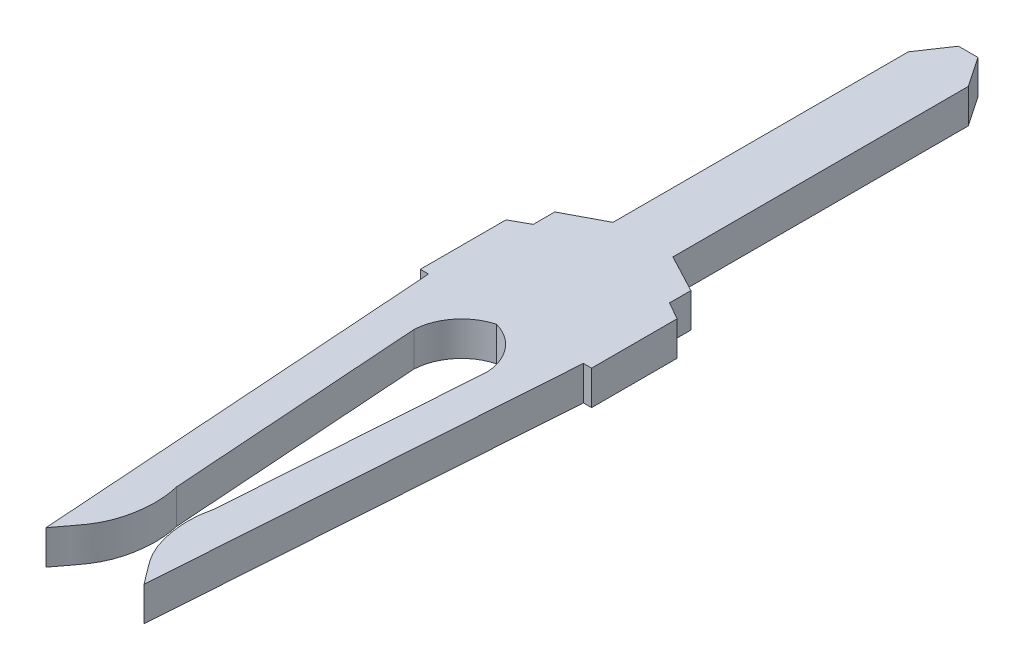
ISO-10303-21;
HEADER;
FILE_DESCRIPTION(('STEP AP214'),'2;1');
FILE_NAME('part.step','',(''),(''),'','','');
FILE_SCHEMA(('AUTOMOTIVE_DESIGN { 1 0 10303 214 1 1 1 1 }'));
ENDSEC;
DATA;
#1=APPLICATION_CONTEXT('core data for automotive mechanical design processes');
#2=APPLICATION_PROTOCOL_DEFINITION('international standard','automotive_design',2000,#1);
#3=PRODUCT_CONTEXT('',#1,'mechanical');
#4=PRODUCT('Part','Part','',(#3));
#5=PRODUCT_RELATED_PRODUCT_CATEGORY('part','',(#4));
#6=PRODUCT_DEFINITION_FORMATION('','',#4);
#7=PRODUCT_DEFINITION_CONTEXT('part definition',#1,'design');
#8=PRODUCT_DEFINITION('design','',#6,#7);
#9=PRODUCT_DEFINITION_SHAPE('','',#8);
#10=(LENGTH_UNIT() NAMED_UNIT(*) SI_UNIT(.MILLI.,.METRE.));
#11=(NAMED_UNIT(*) PLANE_ANGLE_UNIT() SI_UNIT($,.RADIAN.));
#12=(NAMED_UNIT(*) SI_UNIT($,.STERADIAN.) SOLID_ANGLE_UNIT());
#13=UNCERTAINTY_MEASURE_WITH_UNIT(LENGTH_MEASURE(1.E-05),#10,'distance_accuracy_value','');
#14=(GEOMETRIC_REPRESENTATION_CONTEXT(3) GLOBAL_UNCERTAINTY_ASSIGNED_CONTEXT((#13)) GLOBAL_UNIT_ASSIGNED_CONTEXT((#10,
#11,#12)) REPRESENTATION_CONTEXT('',''));
#15=CARTESIAN_POINT('',(0.,0.,0.));
#16=DIRECTION('',(0.,0.,1.));
#17=DIRECTION('',(1.,0.,0.));
#18=AXIS2_PLACEMENT_3D('',#15,#16,#17);
#19=CARTESIAN_POINT('',(12.2250492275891,0.200000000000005,-3.31529917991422));
#20=DIRECTION('',(-0.466469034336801,0.,0.884537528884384));
#21=DIRECTION('',(0.,1.,0.));
#22=AXIS2_PLACEMENT_3D('',#19,#20,#21);
#23=PLANE('',#22);
#24=DIRECTION('',(-0.884537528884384,0.,-0.466469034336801));
#25=VECTOR('',#24,1.);
#26=CARTESIAN_POINT('',(12.2250492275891,-0.199999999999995,-3.31529917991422));
#27=LINE('',#26,#25);
#28=CARTESIAN_POINT('',(12.2250492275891,-0.199999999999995,-3.31529917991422));
#29=VERTEX_POINT('',#28);
#30=CARTESIAN_POINT('',(11.78,-0.199999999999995,-3.55));
#31=VERTEX_POINT('',#30);
#32=EDGE_CURVE('E257',#29,#31,#27,.T.);
#33=ORIENTED_EDGE('',*,*,#32,.T.);
#34=DIRECTION('',(0.,-1.,0.));
#35=VECTOR('',#34,1.);
#36=CARTESIAN_POINT('',(11.78,0.200000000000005,-3.55));
#37=LINE('',#36,#35);
#38=CARTESIAN_POINT('',(11.78,0.200000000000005,-3.55));
#39=VERTEX_POINT('',#38);
#40=EDGE_CURVE('E274',#39,#31,#37,.T.);
#41=ORIENTED_EDGE('',*,*,#40,.F.);
#42=DIRECTION('',(-0.884537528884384,0.,-0.466469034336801));
#43=VECTOR('',#42,1.);
#44=CARTESIAN_POINT('',(12.2250492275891,0.200000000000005,-3.31529917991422));
#45=LINE('',#44,#43);
#46=CARTESIAN_POINT('',(12.2250492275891,0.200000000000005,-3.31529917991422));
#47=VERTEX_POINT('',#46);
#48=EDGE_CURVE('E320',#47,#39,#45,.T.);
#49=ORIENTED_EDGE('',*,*,#48,.F.);
#50=DIRECTION('',(0.,-1.,0.));
#51=VECTOR('',#50,1.);
#52=CARTESIAN_POINT('',(12.2250492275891,0.200000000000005,-3.31529917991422));
#53=LINE('',#52,#51);
#54=EDGE_CURVE('E11',#47,#29,#53,.T.);
#55=ORIENTED_EDGE('',*,*,#54,.T.);
#56=EDGE_LOOP('',(#33,#41,#49,#55));
#57=FACE_BOUND('',#56,.T.);
#58=ADVANCED_FACE('F16',(#57),#23,.F.);
#59=CARTESIAN_POINT('',(12.2250492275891,0.200000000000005,-3.0643625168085));
#60=DIRECTION('',(-1.,0.,0.));
#61=DIRECTION('',(0.,0.,1.));
#62=AXIS2_PLACEMENT_3D('',#59,#60,#61);
#63=PLANE('',#62);
#64=DIRECTION('',(0.,0.,-1.));
#65=VECTOR('',#64,1.);
#66=CARTESIAN_POINT('',(12.2250492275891,-0.199999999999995,-3.0643625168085));
#67=LINE('',#66,#65);
#68=CARTESIAN_POINT('',(12.2250492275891,-0.199999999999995,-3.0643625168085));
#69=VERTEX_POINT('',#68);
#70=EDGE_CURVE('E232',#69,#29,#67,.T.);
#71=ORIENTED_EDGE('',*,*,#70,.T.);
#72=ORIENTED_EDGE('',*,*,#54,.F.);
#73=DIRECTION('',(0.,0.,-1.));
#74=VECTOR('',#73,1.);
#75=CARTESIAN_POINT('',(12.2250492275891,0.200000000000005,-3.0643625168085));
#76=LINE('',#75,#74);
#77=CARTESIAN_POINT('',(12.2250492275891,0.200000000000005,-3.0643625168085));
#78=VERTEX_POINT('',#77);
#79=EDGE_CURVE('E317',#78,#47,#76,.T.);
#80=ORIENTED_EDGE('',*,*,#79,.F.);
#81=DIRECTION('',(0.,-1.,0.));
#82=VECTOR('',#81,1.);
#83=CARTESIAN_POINT('',(12.2250492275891,0.200000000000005,-3.0643625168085));
#84=LINE('',#83,#82);
#85=EDGE_CURVE('E23',#78,#69,#84,.T.);
#86=ORIENTED_EDGE('',*,*,#85,.T.);
#87=EDGE_LOOP('',(#71,#72,#80,#86));
#88=FACE_BOUND('',#87,.T.);
#89=ADVANCED_FACE('F386',(#88),#63,.F.);
#90=CARTESIAN_POINT('',(12.43,0.200000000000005,-2.95));
#91=DIRECTION('',(-0.48727320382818,0.,0.873249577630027));
#92=DIRECTION('',(0.,1.,0.));
#93=AXIS2_PLACEMENT_3D('',#90,#91,#92);
#94=PLANE('',#93);
#95=DIRECTION('',(-0.873249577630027,0.,-0.48727320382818));
#96=VECTOR('',#95,1.);
#97=CARTESIAN_POINT('',(12.43,-0.199999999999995,-2.95));
#98=LINE('',#97,#96);
#99=CARTESIAN_POINT('',(12.43,-0.199999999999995,-2.95));
#100=VERTEX_POINT('',#99);
#101=EDGE_CURVE('E228',#100,#69,#98,.T.);
#102=ORIENTED_EDGE('',*,*,#101,.T.);
#103=ORIENTED_EDGE('',*,*,#85,.F.);
#104=DIRECTION('',(-0.873249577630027,0.,-0.48727320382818));
#105=VECTOR('',#104,1.);
#106=CARTESIAN_POINT('',(12.43,0.200000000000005,-2.95));
#107=LINE('',#106,#105);
#108=CARTESIAN_POINT('',(12.43,0.200000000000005,-2.95));
#109=VERTEX_POINT('',#108);
#110=EDGE_CURVE('E311',#109,#78,#107,.T.);
#111=ORIENTED_EDGE('',*,*,#110,.F.);
#112=DIRECTION('',(0.,-1.,0.));
#113=VECTOR('',#112,1.);
#114=CARTESIAN_POINT('',(12.43,0.200000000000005,-2.95));
#115=LINE('',#114,#113);
#116=EDGE_CURVE('E273',#109,#100,#115,.T.);
#117=ORIENTED_EDGE('',*,*,#116,.T.);
#118=EDGE_LOOP('',(#102,#103,#111,#117));
#119=FACE_BOUND('',#118,.T.);
#120=ADVANCED_FACE('F392',(#119),#94,.F.);
#121=CARTESIAN_POINT('',(12.43,0.200000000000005,-1.95));
#122=DIRECTION('',(-1.,0.,0.));
#123=DIRECTION('',(0.,0.,1.));
#124=AXIS2_PLACEMENT_3D('',#121,#122,#123);
#125=PLANE('',#124);
#126=DIRECTION('',(0.,0.,-1.));
#127=VECTOR('',#126,1.);
#128=CARTESIAN_POINT('',(12.43,-0.199999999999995,-1.95));
#129=LINE('',#128,#127);
#130=CARTESIAN_POINT('',(12.43,-0.199999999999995,-1.95));
#131=VERTEX_POINT('',#130);
#132=EDGE_CURVE('E231',#131,#100,#129,.T.);
#133=ORIENTED_EDGE('',*,*,#132,.T.);
#134=ORIENTED_EDGE('',*,*,#116,.F.);
#135=DIRECTION('',(0.,0.,-1.));
#136=VECTOR('',#135,1.);
#137=CARTESIAN_POINT('',(12.43,0.200000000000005,-1.95));
#138=LINE('',#137,#136);
#139=CARTESIAN_POINT('',(12.43,0.200000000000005,-1.95));
#140=VERTEX_POINT('',#139);
#141=EDGE_CURVE('E308',#140,#109,#138,.T.);
#142=ORIENTED_EDGE('',*,*,#141,.F.);
#143=DIRECTION('',(0.,-1.,0.));
#144=VECTOR('',#143,1.);
#145=CARTESIAN_POINT('',(12.43,0.200000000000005,-1.95));
#146=LINE('',#145,#144);
#147=EDGE_CURVE('E271',#140,#131,#146,.T.);
#148=ORIENTED_EDGE('',*,*,#147,.T.);
#149=EDGE_LOOP('',(#133,#134,#142,#148));
#150=FACE_BOUND('',#149,.T.);
#151=ADVANCED_FACE('F403',(#150),#125,.F.);
#152=CARTESIAN_POINT('',(12.3340609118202,0.200000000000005,-1.95));
#153=DIRECTION('',(0.,0.,-1.));
#154=DIRECTION('',(0.,-1.,0.));
#155=AXIS2_PLACEMENT_3D('',#152,#153,#154);
#156=PLANE('',#155);
#157=DIRECTION('',(1.,0.,0.));
#158=VECTOR('',#157,1.);
#159=CARTESIAN_POINT('',(12.3340609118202,-0.199999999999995,-1.95));
#160=LINE('',#159,#158);
#161=CARTESIAN_POINT('',(12.3340609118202,-0.199999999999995,-1.95));
#162=VERTEX_POINT('',#161);
#163=EDGE_CURVE('E251',#162,#131,#160,.T.);
#164=ORIENTED_EDGE('',*,*,#163,.T.);
#165=ORIENTED_EDGE('',*,*,#147,.F.);
#166=DIRECTION('',(1.,0.,0.));
#167=VECTOR('',#166,1.);
#168=CARTESIAN_POINT('',(12.3340609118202,0.200000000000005,-1.95));
#169=LINE('',#168,#167);
#170=CARTESIAN_POINT('',(12.3340609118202,0.200000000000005,-1.95));
#171=VERTEX_POINT('',#170);
#172=EDGE_CURVE('E305',#171,#140,#169,.T.);
#173=ORIENTED_EDGE('',*,*,#172,.F.);
#174=DIRECTION('',(0.,-1.,0.));
#175=VECTOR('',#174,1.);
#176=CARTESIAN_POINT('',(12.3340609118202,0.200000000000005,-1.95));
#177=LINE('',#176,#175);
#178=EDGE_CURVE('E349',#171,#162,#177,.T.);
#179=ORIENTED_EDGE('',*,*,#178,.T.);
#180=EDGE_LOOP('',(#164,#165,#173,#179));
#181=FACE_BOUND('',#180,.T.);
#182=ADVANCED_FACE('F408',(#181),#156,.F.);
#183=CARTESIAN_POINT('',(11.78,0.200000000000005,-3.55));
#184=DIRECTION('',(-1.,0.,0.));
#185=DIRECTION('',(0.,0.,1.));
#186=AXIS2_PLACEMENT_3D('',#183,#184,#185);
#187=PLANE('',#186);
#188=DIRECTION('',(0.,0.,-1.));
#189=VECTOR('',#188,1.);
#190=CARTESIAN_POINT('',(11.78,-0.199999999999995,-3.55));
#191=LINE('',#190,#189);
#192=CARTESIAN_POINT('',(11.78,-0.199999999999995,-7.));
#193=VERTEX_POINT('',#192);
#194=EDGE_CURVE('E239',#31,#193,#191,.T.);
#195=ORIENTED_EDGE('',*,*,#194,.T.);
#196=DIRECTION('',(0.,-1.,0.));
#197=VECTOR('',#196,1.);
#198=CARTESIAN_POINT('',(11.78,0.200000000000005,-7.));
#199=LINE('',#198,#197);
#200=CARTESIAN_POINT('',(11.78,0.200000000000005,-7.));
#201=VERTEX_POINT('',#200);
#202=EDGE_CURVE('E206',#201,#193,#199,.T.);
#203=ORIENTED_EDGE('',*,*,#202,.F.);
#204=DIRECTION('',(0.,0.,-1.));
#205=VECTOR('',#204,1.);
#206=CARTESIAN_POINT('',(11.78,0.200000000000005,-3.55));
#207=LINE('',#206,#205);
#208=EDGE_CURVE('E324',#39,#201,#207,.T.);
#209=ORIENTED_EDGE('',*,*,#208,.F.);
#210=ORIENTED_EDGE('',*,*,#40,.T.);
#211=EDGE_LOOP('',(#195,#203,#209,#210));
#212=FACE_BOUND('',#211,.T.);
#213=ADVANCED_FACE('F471',(#212),#187,.F.);
#214=CARTESIAN_POINT('',(11.2740651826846,0.200000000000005,-1.27557004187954));
#215=DIRECTION('',(0.,-1.,0.));
#216=DIRECTION('',(0.,0.,-1.));
#217=AXIS2_PLACEMENT_3D('',#214,#215,#216);
#218=CYLINDRICAL_SURFACE('',#217,0.584698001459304);
#219=CARTESIAN_POINT('',(11.2740651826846,-0.199999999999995,-1.27557004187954));
#220=DIRECTION('',(0.,-1.,0.));
#221=DIRECTION('',(-1.,0.,0.));
#222=AXIS2_PLACEMENT_3D('',#219,#220,#221);
#223=CIRCLE('',#222,0.584698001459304);
#224=CARTESIAN_POINT('',(11.43,-0.199999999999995,-1.839091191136));
#225=VERTEX_POINT('',#224);
#226=CARTESIAN_POINT('',(11.8582042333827,-0.199999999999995,-1.30113021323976));
#227=VERTEX_POINT('',#226);
#228=EDGE_CURVE('E245',#225,#227,#223,.T.);
#229=ORIENTED_EDGE('',*,*,#228,.T.);
#230=DIRECTION('',(0.,-1.,0.));
#231=VECTOR('',#230,1.);
#232=CARTESIAN_POINT('',(11.8582042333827,0.200000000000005,-1.30113021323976));
#233=LINE('',#232,#231);
#234=CARTESIAN_POINT('',(11.8582042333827,0.200000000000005,-1.30113021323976));
#235=VERTEX_POINT('',#234);
#236=EDGE_CURVE('E381',#235,#227,#233,.T.);
#237=ORIENTED_EDGE('',*,*,#236,.F.);
#238=CARTESIAN_POINT('',(11.2740651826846,0.200000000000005,-1.27557004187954));
#239=DIRECTION('',(0.,-1.,0.));
#240=DIRECTION('',(-1.,0.,0.));
#241=AXIS2_PLACEMENT_3D('',#238,#239,#240);
#242=CIRCLE('',#241,0.584698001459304);
#243=CARTESIAN_POINT('',(11.43,0.200000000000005,-1.839091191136));
#244=VERTEX_POINT('',#243);
#245=EDGE_CURVE('E248',#244,#235,#242,.T.);
#246=ORIENTED_EDGE('',*,*,#245,.F.);
#247=DIRECTION('',(0.,-1.,0.));
#248=VECTOR('',#247,1.);
#249=CARTESIAN_POINT('',(11.43,0.200000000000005,-1.839091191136));
#250=LINE('',#249,#248);
#251=EDGE_CURVE('E346',#244,#225,#250,.T.);
#252=ORIENTED_EDGE('',*,*,#251,.T.);
#253=EDGE_LOOP('',(#229,#237,#246,#252));
#254=FACE_BOUND('',#253,.T.);
#255=ADVANCED_FACE('F421',(#254),#218,.F.);
#256=CARTESIAN_POINT('',(11.8582042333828,0.200000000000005,-1.30113021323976));
#257=DIRECTION('',(0.997626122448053,0.,0.0688630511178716));
#258=DIRECTION('',(0.,-1.,0.));
#259=AXIS2_PLACEMENT_3D('',#256,#257,#258);
#260=PLANE('',#259);
#261=DIRECTION('',(-0.0688630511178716,0.,0.997626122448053));
#262=VECTOR('',#261,1.);
#263=CARTESIAN_POINT('',(11.8582042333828,-0.199999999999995,-1.30113021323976));
#264=LINE('',#263,#262);
#265=CARTESIAN_POINT('',(11.6528494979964,-0.199999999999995,1.67386501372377));
#266=VERTEX_POINT('',#265);
#267=EDGE_CURVE('E218',#227,#266,#264,.T.);
#268=ORIENTED_EDGE('',*,*,#267,.T.);
#269=DIRECTION('',(0.,-1.,0.));
#270=VECTOR('',#269,1.);
#271=CARTESIAN_POINT('',(11.6528494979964,0.200000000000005,1.67386501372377));
#272=LINE('',#271,#270);
#273=CARTESIAN_POINT('',(11.6528494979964,0.200000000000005,1.67386501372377));
#274=VERTEX_POINT('',#273);
#275=EDGE_CURVE('E347',#274,#266,#272,.T.);
#276=ORIENTED_EDGE('',*,*,#275,.F.);
#277=DIRECTION('',(-0.0688630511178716,0.,0.997626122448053));
#278=VECTOR('',#277,1.);
#279=CARTESIAN_POINT('',(11.8582042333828,0.200000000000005,-1.30113021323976));
#280=LINE('',#279,#278);
#281=EDGE_CURVE('E266',#235,#274,#280,.T.);
#282=ORIENTED_EDGE('',*,*,#281,.F.);
#283=ORIENTED_EDGE('',*,*,#236,.T.);
#284=EDGE_LOOP('',(#268,#276,#282,#283));
#285=FACE_BOUND('',#284,.T.);
#286=ADVANCED_FACE('F417',(#285),#260,.F.);
#287=CARTESIAN_POINT('',(12.0027317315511,0.200000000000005,2.85));
#288=DIRECTION('',(-0.997626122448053,0.,-0.0688630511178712));
#289=DIRECTION('',(-0.0688630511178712,0.,0.997626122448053));
#290=AXIS2_PLACEMENT_3D('',#287,#288,#289);
#291=PLANE('',#290);
#292=DIRECTION('',(0.0688630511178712,0.,-0.997626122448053));
#293=VECTOR('',#292,1.);
#294=CARTESIAN_POINT('',(12.0027317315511,-0.199999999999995,2.85));
#295=LINE('',#294,#293);
#296=CARTESIAN_POINT('',(12.0027317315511,-0.199999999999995,2.85));
#297=VERTEX_POINT('',#296);
#298=EDGE_CURVE('E219',#297,#162,#295,.T.);
#299=ORIENTED_EDGE('',*,*,#298,.T.);
#300=ORIENTED_EDGE('',*,*,#178,.F.);
#301=DIRECTION('',(0.0688630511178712,0.,-0.997626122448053));
#302=VECTOR('',#301,1.);
#303=CARTESIAN_POINT('',(12.0027317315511,0.200000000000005,2.85));
#304=LINE('',#303,#302);
#305=CARTESIAN_POINT('',(12.0027317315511,0.200000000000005,2.85));
#306=VERTEX_POINT('',#305);
#307=EDGE_CURVE('E299',#306,#171,#304,.T.);
#308=ORIENTED_EDGE('',*,*,#307,.F.);
#309=DIRECTION('',(0.,-1.,0.));
#310=VECTOR('',#309,1.);
#311=CARTESIAN_POINT('',(12.0027317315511,0.200000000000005,2.85));
#312=LINE('',#311,#310);
#313=EDGE_CURVE('E350',#306,#297,#312,.T.);
#314=ORIENTED_EDGE('',*,*,#313,.T.);
#315=EDGE_LOOP('',(#299,#300,#308,#314));
#316=FACE_BOUND('',#315,.T.);
#317=ADVANCED_FACE('F411',(#316),#291,.F.);
#318=CARTESIAN_POINT('',(11.6528494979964,0.200000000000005,1.67386501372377));
#319=CARTESIAN_POINT('',(11.6179853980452,0.200000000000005,1.835112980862));
#320=CARTESIAN_POINT('',(11.611441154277,0.200000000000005,2.11077566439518));
#321=CARTESIAN_POINT('',(11.7015396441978,0.200000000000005,2.49313848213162));
#322=CARTESIAN_POINT('',(11.9263228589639,0.200000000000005,2.74017511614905));
#323=CARTESIAN_POINT('',(12.0027317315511,0.200000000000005,2.85));
#324=(BOUNDED_CURVE() B_SPLINE_CURVE(3,(#318,#319,#320,#321,#322,#323),.UNSPECIFIED.,.F.,
.F.) B_SPLINE_CURVE_WITH_KNOTS((4,1,1,4),(0.,0.233999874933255,0.693587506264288,1.),
.UNSPECIFIED.) CURVE() GEOMETRIC_REPRESENTATION_ITEM() RATIONAL_B_SPLINE_CURVE((1.,1.,1.,1.,1.,1.)) REPRESENTATION_ITEM(''));
#325=DIRECTION('',(0.,-1.,0.));
#326=VECTOR('',#325,1.);
#327=SURFACE_OF_LINEAR_EXTRUSION('',#324,#326);
#328=CARTESIAN_POINT('',(11.6528494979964,-0.199999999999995,1.67386501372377));
#329=CARTESIAN_POINT('',(11.6179853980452,-0.199999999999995,1.835112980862));
#330=CARTESIAN_POINT('',(11.611441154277,-0.199999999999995,2.11077566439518));
#331=CARTESIAN_POINT('',(11.7015396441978,-0.199999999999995,2.49313848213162));
#332=CARTESIAN_POINT('',(11.9263228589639,-0.199999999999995,2.74017511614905));
#333=CARTESIAN_POINT('',(12.0027317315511,-0.199999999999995,2.85));
#334=(BOUNDED_CURVE() B_SPLINE_CURVE(3,(#328,#329,#330,#331,#332,#333),.UNSPECIFIED.,.F.,
.F.) B_SPLINE_CURVE_WITH_KNOTS((4,1,1,4),(0.,0.233999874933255,0.693587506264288,1.),
.UNSPECIFIED.) CURVE() GEOMETRIC_REPRESENTATION_ITEM() RATIONAL_B_SPLINE_CURVE((1.,1.,1.,1.,1.,1.)) REPRESENTATION_ITEM(''));
#335=EDGE_CURVE('E213',#266,#297,#334,.T.);
#336=ORIENTED_EDGE('',*,*,#335,.T.);
#337=ORIENTED_EDGE('',*,*,#313,.F.);
#338=CARTESIAN_POINT('',(11.6528494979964,0.200000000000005,1.67386501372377));
#339=CARTESIAN_POINT('',(11.6179853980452,0.200000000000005,1.835112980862));
#340=CARTESIAN_POINT('',(11.611441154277,0.200000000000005,2.11077566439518));
#341=CARTESIAN_POINT('',(11.7015396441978,0.200000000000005,2.49313848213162));
#342=CARTESIAN_POINT('',(11.9263228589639,0.200000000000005,2.74017511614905));
#343=CARTESIAN_POINT('',(12.0027317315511,0.200000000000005,2.85));
#344=(BOUNDED_CURVE() B_SPLINE_CURVE(3,(#338,#339,#340,#341,#342,#343),.UNSPECIFIED.,.F.,
.F.) B_SPLINE_CURVE_WITH_KNOTS((4,1,1,4),(0.,0.233999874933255,0.693587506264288,1.),
.UNSPECIFIED.) CURVE() GEOMETRIC_REPRESENTATION_ITEM() RATIONAL_B_SPLINE_CURVE((1.,1.,1.,1.,1.,1.)) REPRESENTATION_ITEM(''));
#345=EDGE_CURVE('E281',#274,#306,#344,.T.);
#346=ORIENTED_EDGE('',*,*,#345,.F.);
#347=ORIENTED_EDGE('',*,*,#275,.T.);
#348=EDGE_LOOP('',(#336,#337,#346,#347));
#349=FACE_BOUND('',#348,.T.);
#350=ADVANCED_FACE('F414',(#349),#327,.F.);
#351=CARTESIAN_POINT('',(11.43,0.200000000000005,-7.35));
#352=DIRECTION('',(0.,0.,1.));
#353=DIRECTION('',(1.,0.,0.));
#354=AXIS2_PLACEMENT_3D('',#351,#352,#353);
#355=PLANE('',#354);
#356=DIRECTION('',(-1.,0.,0.));
#357=VECTOR('',#356,1.);
#358=CARTESIAN_POINT('',(11.43,-0.199999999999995,-7.35));
#359=LINE('',#358,#357);
#360=CARTESIAN_POINT('',(11.5438737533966,-0.199999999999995,-7.35));
#361=VERTEX_POINT('',#360);
#362=CARTESIAN_POINT('',(11.3161262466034,-0.199999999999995,-7.35));
#363=VERTEX_POINT('',#362);
#364=EDGE_CURVE('E170',#361,#363,#359,.T.);
#365=ORIENTED_EDGE('',*,*,#364,.T.);
#366=DIRECTION('',(0.,-1.,0.));
#367=VECTOR('',#366,1.);
#368=CARTESIAN_POINT('',(11.3161262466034,0.200000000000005,-7.35));
#369=LINE('',#368,#367);
#370=CARTESIAN_POINT('',(11.3161262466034,0.200000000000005,-7.35));
#371=VERTEX_POINT('',#370);
#372=EDGE_CURVE('E174',#371,#363,#369,.T.);
#373=ORIENTED_EDGE('',*,*,#372,.F.);
#374=DIRECTION('',(-1.,0.,0.));
#375=VECTOR('',#374,1.);
#376=CARTESIAN_POINT('',(11.43,0.200000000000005,-7.35));
#377=LINE('',#376,#375);
#378=CARTESIAN_POINT('',(11.5438737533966,0.200000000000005,-7.35));
#379=VERTEX_POINT('',#378);
#380=EDGE_CURVE('E332',#379,#371,#377,.T.);
#381=ORIENTED_EDGE('',*,*,#380,.F.);
#382=DIRECTION('',(0.,-1.,0.));
#383=VECTOR('',#382,1.);
#384=CARTESIAN_POINT('',(11.5438737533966,0.200000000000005,-7.35));
#385=LINE('',#384,#383);
#386=EDGE_CURVE('E176',#379,#361,#385,.T.);
#387=ORIENTED_EDGE('',*,*,#386,.T.);
#388=EDGE_LOOP('',(#365,#373,#381,#387));
#389=FACE_BOUND('',#388,.T.);
#390=ADVANCED_FACE('F172',(#389),#355,.F.);
#391=CARTESIAN_POINT('',(11.78,0.200000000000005,-7.));
#392=DIRECTION('',(-0.828984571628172,0.,0.559271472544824));
#393=DIRECTION('',(0.,1.,0.));
#394=AXIS2_PLACEMENT_3D('',#391,#392,#393);
#395=PLANE('',#394);
#396=DIRECTION('',(-0.559271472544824,0.,-0.828984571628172));
#397=VECTOR('',#396,1.);
#398=CARTESIAN_POINT('',(11.78,-0.199999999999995,-7.));
#399=LINE('',#398,#397);
#400=EDGE_CURVE('E181',#193,#361,#399,.T.);
#401=ORIENTED_EDGE('',*,*,#400,.T.);
#402=ORIENTED_EDGE('',*,*,#386,.F.);
#403=DIRECTION('',(-0.559271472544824,0.,-0.828984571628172));
#404=VECTOR('',#403,1.);
#405=CARTESIAN_POINT('',(11.78,0.200000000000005,-7.));
#406=LINE('',#405,#404);
#407=EDGE_CURVE('E329',#201,#379,#406,.T.);
#408=ORIENTED_EDGE('',*,*,#407,.F.);
#409=ORIENTED_EDGE('',*,*,#202,.T.);
#410=EDGE_LOOP('',(#401,#402,#408,#409));
#411=FACE_BOUND('',#410,.T.);
#412=ADVANCED_FACE('F453',(#411),#395,.F.);
#413=CARTESIAN_POINT('',(11.08,0.200000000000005,-7.));
#414=DIRECTION('',(1.,0.,0.));
#415=DIRECTION('',(0.,1.,0.));
#416=AXIS2_PLACEMENT_3D('',#413,#414,#415);
#417=PLANE('',#416);
#418=DIRECTION('',(0.,0.,1.));
#419=VECTOR('',#418,1.);
#420=CARTESIAN_POINT('',(11.08,-0.199999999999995,-7.));
#421=LINE('',#420,#419);
#422=CARTESIAN_POINT('',(11.08,-0.199999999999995,-7.));
#423=VERTEX_POINT('',#422);
#424=CARTESIAN_POINT('',(11.08,-0.199999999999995,-3.55));
#425=VERTEX_POINT('',#424);
#426=EDGE_CURVE('E195',#423,#425,#421,.T.);
#427=ORIENTED_EDGE('',*,*,#426,.T.);
#428=DIRECTION('',(0.,-1.,0.));
#429=VECTOR('',#428,1.);
#430=CARTESIAN_POINT('',(11.08,0.200000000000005,-3.55));
#431=LINE('',#430,#429);
#432=CARTESIAN_POINT('',(11.08,0.200000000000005,-3.55));
#433=VERTEX_POINT('',#432);
#434=EDGE_CURVE('E182',#433,#425,#431,.T.);
#435=ORIENTED_EDGE('',*,*,#434,.F.);
#436=DIRECTION('',(0.,0.,1.));
#437=VECTOR('',#436,1.);
#438=CARTESIAN_POINT('',(11.08,0.200000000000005,-7.));
#439=LINE('',#438,#437);
#440=CARTESIAN_POINT('',(11.08,0.200000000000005,-7.));
#441=VERTEX_POINT('',#440);
#442=EDGE_CURVE('E191',#441,#433,#439,.T.);
#443=ORIENTED_EDGE('',*,*,#442,.F.);
#444=DIRECTION('',(0.,-1.,0.));
#445=VECTOR('',#444,1.);
#446=CARTESIAN_POINT('',(11.08,0.200000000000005,-7.));
#447=LINE('',#446,#445);
#448=EDGE_CURVE('E197',#441,#423,#447,.T.);
#449=ORIENTED_EDGE('',*,*,#448,.T.);
#450=EDGE_LOOP('',(#427,#435,#443,#449));
#451=FACE_BOUND('',#450,.T.);
#452=ADVANCED_FACE('F445',(#451),#417,.F.);
#453=CARTESIAN_POINT('',(10.43,0.200000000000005,-2.95));
#454=DIRECTION('',(1.,0.,0.));
#455=DIRECTION('',(0.,1.,0.));
#456=AXIS2_PLACEMENT_3D('',#453,#454,#455);
#457=PLANE('',#456);
#458=DIRECTION('',(0.,0.,1.));
#459=VECTOR('',#458,1.);
#460=CARTESIAN_POINT('',(10.43,-0.199999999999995,-2.95));
#461=LINE('',#460,#459);
#462=CARTESIAN_POINT('',(10.43,-0.199999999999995,-2.95));
#463=VERTEX_POINT('',#462);
#464=CARTESIAN_POINT('',(10.43,-0.199999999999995,-1.95));
#465=VERTEX_POINT('',#464);
#466=EDGE_CURVE('E370',#463,#465,#461,.T.);
#467=ORIENTED_EDGE('',*,*,#466,.T.);
#468=DIRECTION('',(0.,-1.,0.));
#469=VECTOR('',#468,1.);
#470=CARTESIAN_POINT('',(10.43,0.200000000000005,-1.95));
#471=LINE('',#470,#469);
#472=CARTESIAN_POINT('',(10.43,0.200000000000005,-1.95));
#473=VERTEX_POINT('',#472);
#474=EDGE_CURVE('E207',#473,#465,#471,.T.);
#475=ORIENTED_EDGE('',*,*,#474,.F.);
#476=DIRECTION('',(0.,0.,1.));
#477=VECTOR('',#476,1.);
#478=CARTESIAN_POINT('',(10.43,0.200000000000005,-2.95));
#479=LINE('',#478,#477);
#480=CARTESIAN_POINT('',(10.43,0.200000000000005,-2.95));
#481=VERTEX_POINT('',#480);
#482=EDGE_CURVE('E233',#481,#473,#479,.T.);
#483=ORIENTED_EDGE('',*,*,#482,.F.);
#484=DIRECTION('',(0.,-1.,0.));
#485=VECTOR('',#484,1.);
#486=CARTESIAN_POINT('',(10.43,0.200000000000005,-2.95));
#487=LINE('',#486,#485);
#488=EDGE_CURVE('E38',#481,#463,#487,.T.);
#489=ORIENTED_EDGE('',*,*,#488,.T.);
#490=EDGE_LOOP('',(#467,#475,#483,#489));
#491=FACE_BOUND('',#490,.T.);
#492=ADVANCED_FACE('F443',(#491),#457,.F.);
#493=CARTESIAN_POINT('',(10.43,0.200000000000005,-1.95));
#494=DIRECTION('',(0.,0.,-1.));
#495=DIRECTION('',(-1.,0.,0.));
#496=AXIS2_PLACEMENT_3D('',#493,#494,#495);
#497=PLANE('',#496);
#498=DIRECTION('',(1.,0.,0.));
#499=VECTOR('',#498,1.);
#500=CARTESIAN_POINT('',(10.43,-0.199999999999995,-1.95));
#501=LINE('',#500,#499);
#502=CARTESIAN_POINT('',(10.5259390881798,-0.199999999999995,-1.95));
#503=VERTEX_POINT('',#502);
#504=EDGE_CURVE('E367',#465,#503,#501,.T.);
#505=ORIENTED_EDGE('',*,*,#504,.T.);
#506=DIRECTION('',(0.,-1.,0.));
#507=VECTOR('',#506,1.);
#508=CARTESIAN_POINT('',(10.5259390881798,0.200000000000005,-1.95));
#509=LINE('',#508,#507);
#510=CARTESIAN_POINT('',(10.5259390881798,0.200000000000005,-1.95));
#511=VERTEX_POINT('',#510);
#512=EDGE_CURVE('E326',#511,#503,#509,.T.);
#513=ORIENTED_EDGE('',*,*,#512,.F.);
#514=DIRECTION('',(1.,0.,0.));
#515=VECTOR('',#514,1.);
#516=CARTESIAN_POINT('',(10.43,0.200000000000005,-1.95));
#517=LINE('',#516,#515);
#518=EDGE_CURVE('E236',#473,#511,#517,.T.);
#519=ORIENTED_EDGE('',*,*,#518,.F.);
#520=ORIENTED_EDGE('',*,*,#474,.T.);
#521=EDGE_LOOP('',(#505,#513,#519,#520));
#522=FACE_BOUND('',#521,.T.);
#523=ADVANCED_FACE('F441',(#522),#497,.F.);
#524=CARTESIAN_POINT('',(10.5259390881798,0.200000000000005,-1.95));
#525=DIRECTION('',(0.997626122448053,0.,-0.0688630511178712));
#526=DIRECTION('',(0.,-1.,0.));
#527=AXIS2_PLACEMENT_3D('',#524,#525,#526);
#528=PLANE('',#527);
#529=DIRECTION('',(0.0688630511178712,0.,0.997626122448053));
#530=VECTOR('',#529,1.);
#531=CARTESIAN_POINT('',(10.5259390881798,-0.199999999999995,-1.95));
#532=LINE('',#531,#530);
#533=CARTESIAN_POINT('',(10.8572682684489,-0.199999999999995,2.85));
#534=VERTEX_POINT('',#533);
#535=EDGE_CURVE('E361',#503,#534,#532,.T.);
#536=ORIENTED_EDGE('',*,*,#535,.T.);
#537=DIRECTION('',(0.,-1.,0.));
#538=VECTOR('',#537,1.);
#539=CARTESIAN_POINT('',(10.8572682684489,0.200000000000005,2.85));
#540=LINE('',#539,#538);
#541=CARTESIAN_POINT('',(10.8572682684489,0.200000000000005,2.85));
#542=VERTEX_POINT('',#541);
#543=EDGE_CURVE('E375',#542,#534,#540,.T.);
#544=ORIENTED_EDGE('',*,*,#543,.F.);
#545=DIRECTION('',(0.0688630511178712,0.,0.997626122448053));
#546=VECTOR('',#545,1.);
#547=CARTESIAN_POINT('',(10.5259390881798,0.200000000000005,-1.95));
#548=LINE('',#547,#546);
#549=EDGE_CURVE('E254',#511,#542,#548,.T.);
#550=ORIENTED_EDGE('',*,*,#549,.F.);
#551=ORIENTED_EDGE('',*,*,#512,.T.);
#552=EDGE_LOOP('',(#536,#544,#550,#551));
#553=FACE_BOUND('',#552,.T.);
#554=ADVANCED_FACE('F436',(#553),#528,.F.);
#555=CARTESIAN_POINT('',(10.8572682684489,0.200000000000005,2.85));
#556=CARTESIAN_POINT('',(10.9336771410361,0.200000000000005,2.74017511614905));
#557=CARTESIAN_POINT('',(11.1584603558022,0.200000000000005,2.49313848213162));
#558=CARTESIAN_POINT('',(11.248558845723,0.200000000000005,2.11077566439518));
#559=CARTESIAN_POINT('',(11.2420146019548,0.200000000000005,1.835112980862));
#560=CARTESIAN_POINT('',(11.2071505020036,0.200000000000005,1.67386501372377));
#561=(BOUNDED_CURVE() B_SPLINE_CURVE(3,(#555,#556,#557,#558,#559,#560),.UNSPECIFIED.,.F.,
.F.) B_SPLINE_CURVE_WITH_KNOTS((4,1,1,4),(0.,0.306412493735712,0.766000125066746,1.),
.UNSPECIFIED.) CURVE() GEOMETRIC_REPRESENTATION_ITEM() RATIONAL_B_SPLINE_CURVE((1.,1.,1.,1.,1.,1.)) REPRESENTATION_ITEM(''));
#562=DIRECTION('',(0.,-1.,0.));
#563=VECTOR('',#562,1.);
#564=SURFACE_OF_LINEAR_EXTRUSION('',#561,#563);
#565=CARTESIAN_POINT('',(10.8572682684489,-0.199999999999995,2.85));
#566=CARTESIAN_POINT('',(10.9336771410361,-0.199999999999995,2.74017511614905));
#567=CARTESIAN_POINT('',(11.1584603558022,-0.199999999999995,2.49313848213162));
#568=CARTESIAN_POINT('',(11.248558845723,-0.199999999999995,2.11077566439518));
#569=CARTESIAN_POINT('',(11.2420146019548,-0.199999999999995,1.835112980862));
#570=CARTESIAN_POINT('',(11.2071505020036,-0.199999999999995,1.67386501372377));
#571=(BOUNDED_CURVE() B_SPLINE_CURVE(3,(#565,#566,#567,#568,#569,#570),.UNSPECIFIED.,.F.,
.F.) B_SPLINE_CURVE_WITH_KNOTS((4,1,1,4),(0.,0.306412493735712,0.766000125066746,1.),
.UNSPECIFIED.) CURVE() GEOMETRIC_REPRESENTATION_ITEM() RATIONAL_B_SPLINE_CURVE((1.,1.,1.,1.,1.,1.)) REPRESENTATION_ITEM(''));
#572=CARTESIAN_POINT('',(11.2071505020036,-0.199999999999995,1.67386501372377));
#573=VERTEX_POINT('',#572);
#574=EDGE_CURVE('E263',#534,#573,#571,.T.);
#575=ORIENTED_EDGE('',*,*,#574,.T.);
#576=DIRECTION('',(0.,-1.,0.));
#577=VECTOR('',#576,1.);
#578=CARTESIAN_POINT('',(11.2071505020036,0.200000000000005,1.67386501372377));
#579=LINE('',#578,#577);
#580=CARTESIAN_POINT('',(11.2071505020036,0.200000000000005,1.67386501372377));
#581=VERTEX_POINT('',#580);
#582=EDGE_CURVE('E340',#581,#573,#579,.T.);
#583=ORIENTED_EDGE('',*,*,#582,.F.);
#584=CARTESIAN_POINT('',(10.8572682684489,0.200000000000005,2.85));
#585=CARTESIAN_POINT('',(10.9336771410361,0.200000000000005,2.74017511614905));
#586=CARTESIAN_POINT('',(11.1584603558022,0.200000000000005,2.49313848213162));
#587=CARTESIAN_POINT('',(11.248558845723,0.200000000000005,2.11077566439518));
#588=CARTESIAN_POINT('',(11.2420146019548,0.200000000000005,1.835112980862));
#589=CARTESIAN_POINT('',(11.2071505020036,0.200000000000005,1.67386501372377));
#590=(BOUNDED_CURVE() B_SPLINE_CURVE(3,(#584,#585,#586,#587,#588,#589),.UNSPECIFIED.,.F.,
.F.) B_SPLINE_CURVE_WITH_KNOTS((4,1,1,4),(0.,0.306412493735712,0.766000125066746,1.),
.UNSPECIFIED.) CURVE() GEOMETRIC_REPRESENTATION_ITEM() RATIONAL_B_SPLINE_CURVE((1.,1.,1.,1.,1.,1.)) REPRESENTATION_ITEM(''));
#591=EDGE_CURVE('E227',#542,#581,#590,.T.);
#592=ORIENTED_EDGE('',*,*,#591,.F.);
#593=ORIENTED_EDGE('',*,*,#543,.T.);
#594=EDGE_LOOP('',(#575,#583,#592,#593));
#595=FACE_BOUND('',#594,.T.);
#596=ADVANCED_FACE('F433',(#595),#564,.F.);
#597=CARTESIAN_POINT('',(10.6349507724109,0.200000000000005,-3.0643625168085));
#598=DIRECTION('',(0.48727320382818,0.,0.873249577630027));
#599=DIRECTION('',(0.,-1.,0.));
#600=AXIS2_PLACEMENT_3D('',#597,#598,#599);
#601=PLANE('',#600);
#602=DIRECTION('',(-0.873249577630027,0.,0.48727320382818));
#603=VECTOR('',#602,1.);
#604=CARTESIAN_POINT('',(10.6349507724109,-0.199999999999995,-3.0643625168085));
#605=LINE('',#604,#603);
#606=CARTESIAN_POINT('',(10.6349507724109,-0.199999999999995,-3.0643625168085));
#607=VERTEX_POINT('',#606);
#608=EDGE_CURVE('E314',#607,#463,#605,.T.);
#609=ORIENTED_EDGE('',*,*,#608,.T.);
#610=ORIENTED_EDGE('',*,*,#488,.F.);
#611=DIRECTION('',(-0.873249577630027,0.,0.48727320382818));
#612=VECTOR('',#611,1.);
#613=CARTESIAN_POINT('',(10.6349507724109,0.200000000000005,-3.0643625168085));
#614=LINE('',#613,#612);
#615=CARTESIAN_POINT('',(10.6349507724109,0.200000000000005,-3.0643625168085));
#616=VERTEX_POINT('',#615);
#617=EDGE_CURVE('E237',#616,#481,#614,.T.);
#618=ORIENTED_EDGE('',*,*,#617,.F.);
#619=DIRECTION('',(0.,-1.,0.));
#620=VECTOR('',#619,1.);
#621=CARTESIAN_POINT('',(10.6349507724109,0.200000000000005,-3.0643625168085));
#622=LINE('',#621,#620);
#623=EDGE_CURVE('E30',#616,#607,#622,.T.);
#624=ORIENTED_EDGE('',*,*,#623,.T.);
#625=EDGE_LOOP('',(#609,#610,#618,#624));
#626=FACE_BOUND('',#625,.T.);
#627=ADVANCED_FACE('F488',(#626),#601,.F.);
#628=CARTESIAN_POINT('',(10.6349507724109,0.200000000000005,-3.31529917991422));
#629=DIRECTION('',(1.,0.,0.));
#630=DIRECTION('',(0.,1.,0.));
#631=AXIS2_PLACEMENT_3D('',#628,#629,#630);
#632=PLANE('',#631);
#633=DIRECTION('',(0.,0.,1.));
#634=VECTOR('',#633,1.);
#635=CARTESIAN_POINT('',(10.6349507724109,-0.199999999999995,-3.31529917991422));
#636=LINE('',#635,#634);
#637=CARTESIAN_POINT('',(10.6349507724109,-0.199999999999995,-3.31529917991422));
#638=VERTEX_POINT('',#637);
#639=EDGE_CURVE('E312',#638,#607,#636,.T.);
#640=ORIENTED_EDGE('',*,*,#639,.T.);
#641=ORIENTED_EDGE('',*,*,#623,.F.);
#642=DIRECTION('',(0.,0.,1.));
#643=VECTOR('',#642,1.);
#644=CARTESIAN_POINT('',(10.6349507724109,0.200000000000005,-3.31529917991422));
#645=LINE('',#644,#643);
#646=CARTESIAN_POINT('',(10.6349507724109,0.200000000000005,-3.31529917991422));
#647=VERTEX_POINT('',#646);
#648=EDGE_CURVE('E260',#647,#616,#645,.T.);
#649=ORIENTED_EDGE('',*,*,#648,.F.);
#650=DIRECTION('',(0.,-1.,0.));
#651=VECTOR('',#650,1.);
#652=CARTESIAN_POINT('',(10.6349507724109,0.200000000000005,-3.31529917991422));
#653=LINE('',#652,#651);
#654=EDGE_CURVE('E211',#647,#638,#653,.T.);
#655=ORIENTED_EDGE('',*,*,#654,.T.);
#656=EDGE_LOOP('',(#640,#641,#649,#655));
#657=FACE_BOUND('',#656,.T.);
#658=ADVANCED_FACE('F491',(#657),#632,.F.);
#659=CARTESIAN_POINT('',(11.1838483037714,-0.199999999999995,2.32610141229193));
#660=DIRECTION('',(0.,1.,0.));
#661=DIRECTION('',(1.,0.,0.));
#662=AXIS2_PLACEMENT_3D('',#659,#660,#661);
#663=PLANE('',#662);
#664=DIRECTION('',(-0.559271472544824,0.,0.828984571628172));
#665=VECTOR('',#664,1.);
#666=CARTESIAN_POINT('',(11.3161262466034,-0.199999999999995,-7.35));
#667=LINE('',#666,#665);
#668=EDGE_CURVE('E188',#363,#423,#667,.T.);
#669=ORIENTED_EDGE('',*,*,#668,.F.);
#670=ORIENTED_EDGE('',*,*,#364,.F.);
#671=ORIENTED_EDGE('',*,*,#400,.F.);
#672=ORIENTED_EDGE('',*,*,#194,.F.);
#673=ORIENTED_EDGE('',*,*,#32,.F.);
#674=ORIENTED_EDGE('',*,*,#70,.F.);
#675=ORIENTED_EDGE('',*,*,#101,.F.);
#676=ORIENTED_EDGE('',*,*,#132,.F.);
#677=ORIENTED_EDGE('',*,*,#163,.F.);
#678=ORIENTED_EDGE('',*,*,#298,.F.);
#679=ORIENTED_EDGE('',*,*,#335,.F.);
#680=ORIENTED_EDGE('',*,*,#267,.F.);
#681=ORIENTED_EDGE('',*,*,#228,.F.);
#682=CARTESIAN_POINT('',(11.5859348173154,-0.199999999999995,-1.27557004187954));
#683=DIRECTION('',(0.,-1.,0.));
#684=DIRECTION('',(1.,0.,0.));
#685=AXIS2_PLACEMENT_3D('',#682,#683,#684);
#686=CIRCLE('',#685,0.584698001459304);
#687=CARTESIAN_POINT('',(11.0017957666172,-0.199999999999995,-1.30113021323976));
#688=VERTEX_POINT('',#687);
#689=EDGE_CURVE('E343',#688,#225,#686,.T.);
#690=ORIENTED_EDGE('',*,*,#689,.F.);
#691=DIRECTION('',(-0.0688630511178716,0.,-0.997626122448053));
#692=VECTOR('',#691,1.);
#693=CARTESIAN_POINT('',(11.2071505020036,-0.199999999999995,1.67386501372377));
#694=LINE('',#693,#692);
#695=EDGE_CURVE('E334',#573,#688,#694,.T.);
#696=ORIENTED_EDGE('',*,*,#695,.F.);
#697=ORIENTED_EDGE('',*,*,#574,.F.);
#698=ORIENTED_EDGE('',*,*,#535,.F.);
#699=ORIENTED_EDGE('',*,*,#504,.F.);
#700=ORIENTED_EDGE('',*,*,#466,.F.);
#701=ORIENTED_EDGE('',*,*,#608,.F.);
#702=ORIENTED_EDGE('',*,*,#639,.F.);
#703=DIRECTION('',(-0.884537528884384,0.,0.466469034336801));
#704=VECTOR('',#703,1.);
#705=CARTESIAN_POINT('',(11.08,-0.199999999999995,-3.55));
#706=LINE('',#705,#704);
#707=EDGE_CURVE('E353',#425,#638,#706,.T.);
#708=ORIENTED_EDGE('',*,*,#707,.F.);
#709=ORIENTED_EDGE('',*,*,#426,.F.);
#710=EDGE_LOOP('',(#669,#670,#671,#672,#673,#674,#675,#676,#677,#678,#679,#680,#681,#690,#696,
#697,#698,#699,#700,#701,#702,#708,#709));
#711=FACE_BOUND('',#710,.T.);
#712=ADVANCED_FACE('F193',(#711),#663,.F.);
#713=CARTESIAN_POINT('',(11.08,0.200000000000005,-3.55));
#714=DIRECTION('',(0.466469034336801,0.,0.884537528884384));
#715=DIRECTION('',(0.,-1.,0.));
#716=AXIS2_PLACEMENT_3D('',#713,#714,#715);
#717=PLANE('',#716);
#718=ORIENTED_EDGE('',*,*,#707,.T.);
#719=ORIENTED_EDGE('',*,*,#654,.F.);
#720=DIRECTION('',(-0.884537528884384,0.,0.466469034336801));
#721=VECTOR('',#720,1.);
#722=CARTESIAN_POINT('',(11.08,0.200000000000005,-3.55));
#723=LINE('',#722,#721);
#724=EDGE_CURVE('E242',#433,#647,#723,.T.);
#725=ORIENTED_EDGE('',*,*,#724,.F.);
#726=ORIENTED_EDGE('',*,*,#434,.T.);
#727=EDGE_LOOP('',(#718,#719,#725,#726));
#728=FACE_BOUND('',#727,.T.);
#729=ADVANCED_FACE('F496',(#728),#717,.F.);
#730=CARTESIAN_POINT('',(11.5859348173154,0.200000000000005,-1.27557004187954));
#731=DIRECTION('',(0.,-1.,0.));
#732=DIRECTION('',(0.,0.,-1.));
#733=AXIS2_PLACEMENT_3D('',#730,#731,#732);
#734=CYLINDRICAL_SURFACE('',#733,0.584698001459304);
#735=ORIENTED_EDGE('',*,*,#689,.T.);
#736=ORIENTED_EDGE('',*,*,#251,.F.);
#737=CARTESIAN_POINT('',(11.5859348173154,0.200000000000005,-1.27557004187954));
#738=DIRECTION('',(0.,-1.,0.));
#739=DIRECTION('',(1.,0.,0.));
#740=AXIS2_PLACEMENT_3D('',#737,#738,#739);
#741=CIRCLE('',#740,0.584698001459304);
#742=CARTESIAN_POINT('',(11.0017957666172,0.200000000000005,-1.30113021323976));
#743=VERTEX_POINT('',#742);
#744=EDGE_CURVE('E226',#743,#244,#741,.T.);
#745=ORIENTED_EDGE('',*,*,#744,.F.);
#746=DIRECTION('',(0.,-1.,0.));
#747=VECTOR('',#746,1.);
#748=CARTESIAN_POINT('',(11.0017957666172,0.200000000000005,-1.30113021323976));
#749=LINE('',#748,#747);
#750=EDGE_CURVE('E337',#743,#688,#749,.T.);
#751=ORIENTED_EDGE('',*,*,#750,.T.);
#752=EDGE_LOOP('',(#735,#736,#745,#751));
#753=FACE_BOUND('',#752,.T.);
#754=ADVANCED_FACE('F424',(#753),#734,.F.);
#755=CARTESIAN_POINT('',(11.2071505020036,0.200000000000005,1.67386501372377));
#756=DIRECTION('',(-0.997626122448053,0.,0.0688630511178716));
#757=DIRECTION('',(0.,1.,0.));
#758=AXIS2_PLACEMENT_3D('',#755,#756,#757);
#759=PLANE('',#758);
#760=ORIENTED_EDGE('',*,*,#695,.T.);
#761=ORIENTED_EDGE('',*,*,#750,.F.);
#762=DIRECTION('',(-0.0688630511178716,0.,-0.997626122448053));
#763=VECTOR('',#762,1.);
#764=CARTESIAN_POINT('',(11.2071505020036,0.200000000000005,1.67386501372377));
#765=LINE('',#764,#763);
#766=EDGE_CURVE('E220',#581,#743,#765,.T.);
#767=ORIENTED_EDGE('',*,*,#766,.F.);
#768=ORIENTED_EDGE('',*,*,#582,.T.);
#769=EDGE_LOOP('',(#760,#761,#767,#768));
#770=FACE_BOUND('',#769,.T.);
#771=ADVANCED_FACE('F429',(#770),#759,.F.);
#772=CARTESIAN_POINT('',(11.1838483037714,0.200000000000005,2.32610141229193));
#773=DIRECTION('',(0.,1.,0.));
#774=DIRECTION('',(1.,0.,0.));
#775=AXIS2_PLACEMENT_3D('',#772,#773,#774);
#776=PLANE('',#775);
#777=DIRECTION('',(-0.559271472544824,0.,0.828984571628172));
#778=VECTOR('',#777,1.);
#779=CARTESIAN_POINT('',(11.3161262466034,0.200000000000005,-7.35));
#780=LINE('',#779,#778);
#781=EDGE_CURVE('E190',#371,#441,#780,.T.);
#782=ORIENTED_EDGE('',*,*,#781,.T.);
#783=ORIENTED_EDGE('',*,*,#442,.T.);
#784=ORIENTED_EDGE('',*,*,#724,.T.);
#785=ORIENTED_EDGE('',*,*,#648,.T.);
#786=ORIENTED_EDGE('',*,*,#617,.T.);
#787=ORIENTED_EDGE('',*,*,#482,.T.);
#788=ORIENTED_EDGE('',*,*,#518,.T.);
#789=ORIENTED_EDGE('',*,*,#549,.T.);
#790=ORIENTED_EDGE('',*,*,#591,.T.);
#791=ORIENTED_EDGE('',*,*,#766,.T.);
#792=ORIENTED_EDGE('',*,*,#744,.T.);
#793=ORIENTED_EDGE('',*,*,#245,.T.);
#794=ORIENTED_EDGE('',*,*,#281,.T.);
#795=ORIENTED_EDGE('',*,*,#345,.T.);
#796=ORIENTED_EDGE('',*,*,#307,.T.);
#797=ORIENTED_EDGE('',*,*,#172,.T.);
#798=ORIENTED_EDGE('',*,*,#141,.T.);
#799=ORIENTED_EDGE('',*,*,#110,.T.);
#800=ORIENTED_EDGE('',*,*,#79,.T.);
#801=ORIENTED_EDGE('',*,*,#48,.T.);
#802=ORIENTED_EDGE('',*,*,#208,.T.);
#803=ORIENTED_EDGE('',*,*,#407,.T.);
#804=ORIENTED_EDGE('',*,*,#380,.T.);
#805=EDGE_LOOP('',(#782,#783,#784,#785,#786,#787,#788,#789,#790,#791,#792,#793,#794,#795,#796,
#797,#798,#799,#800,#801,#802,#803,#804));
#806=FACE_BOUND('',#805,.T.);
#807=ADVANCED_FACE('F399',(#806),#776,.T.);
#808=CARTESIAN_POINT('',(11.3161262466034,0.200000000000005,-7.35));
#809=DIRECTION('',(0.828984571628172,0.,0.559271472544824));
#810=DIRECTION('',(0.,-1.,0.));
#811=AXIS2_PLACEMENT_3D('',#808,#809,#810);
#812=PLANE('',#811);
#813=ORIENTED_EDGE('',*,*,#668,.T.);
#814=ORIENTED_EDGE('',*,*,#448,.F.);
#815=ORIENTED_EDGE('',*,*,#781,.F.);
#816=ORIENTED_EDGE('',*,*,#372,.T.);
#817=EDGE_LOOP('',(#813,#814,#815,#816));
#818=FACE_BOUND('',#817,.T.);
#819=ADVANCED_FACE('F186',(#818),#812,.F.);
#820=CLOSED_SHELL('',(#58,#89,#120,#151,#182,#213,#255,#286,#317,#350,#390,#412,#452,#492,#523,
#554,#596,#627,#658,#712,#729,#754,#771,#807,#819));
#821=MANIFOLD_SOLID_BREP('B1',#820);
#822=ADVANCED_BREP_SHAPE_REPRESENTATION('',(#18,#821),#14);
#823=SHAPE_DEFINITION_REPRESENTATION(#9,#822);
ENDSEC;
END-ISO-10303-21;
